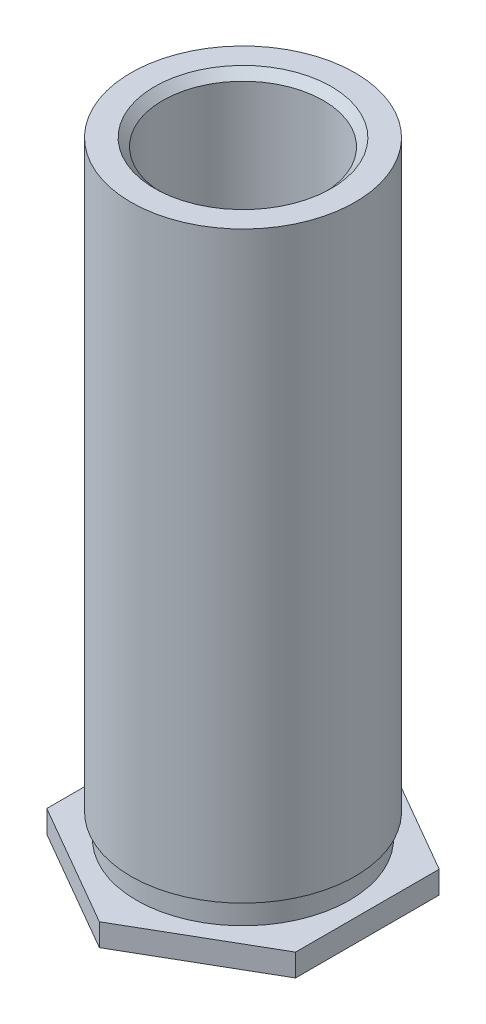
from build123d import *

# Parameters (mm, degrees)
HEXDIESKE_R  = 4.5825
HEXDIE_DEPTH = 0.712


with BuildPart() as part:
    # BodySke → Body (revolve)
    with BuildSketch(Plane.XY, mode=Mode.PRIVATE) as body_sk:
        Polygon((3.56, 0), (4.582, 0), (4.582, 0.712), (3.382, 0.712), (3.382, 1.4596), (3.56, 1.4596), (3.56, 20), (2.805, 20), (2.55, 19.745), (2.55, 0.26008), (2.805, 0.00508), (3.56, 0.00508), align=None)
    revolve(body_sk.sketch.rotate(Axis((0, 0, 0), (0, 1, 0)), 90), axis=Axis((0, 0, 0), (0, 1, 0)))

    # HexDieSke → HexDie (cut)
    with BuildSketch(Plane(origin=(0, 0.712, 0), x_dir=(-1, 0, 0), z_dir=(0, 1, 0))):
        Circle(HEXDIESKE_R)
        Polygon((0, 4.561067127), (3.95, 2.280533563), (3.95, -2.280533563), (0, -4.561067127), (-3.95, -2.280533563), (-3.95, 2.280533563), align=None, mode=Mode.SUBTRACT)
    extrude(amount=-HEXDIE_DEPTH, mode=Mode.SUBTRACT)


solid = part.part
